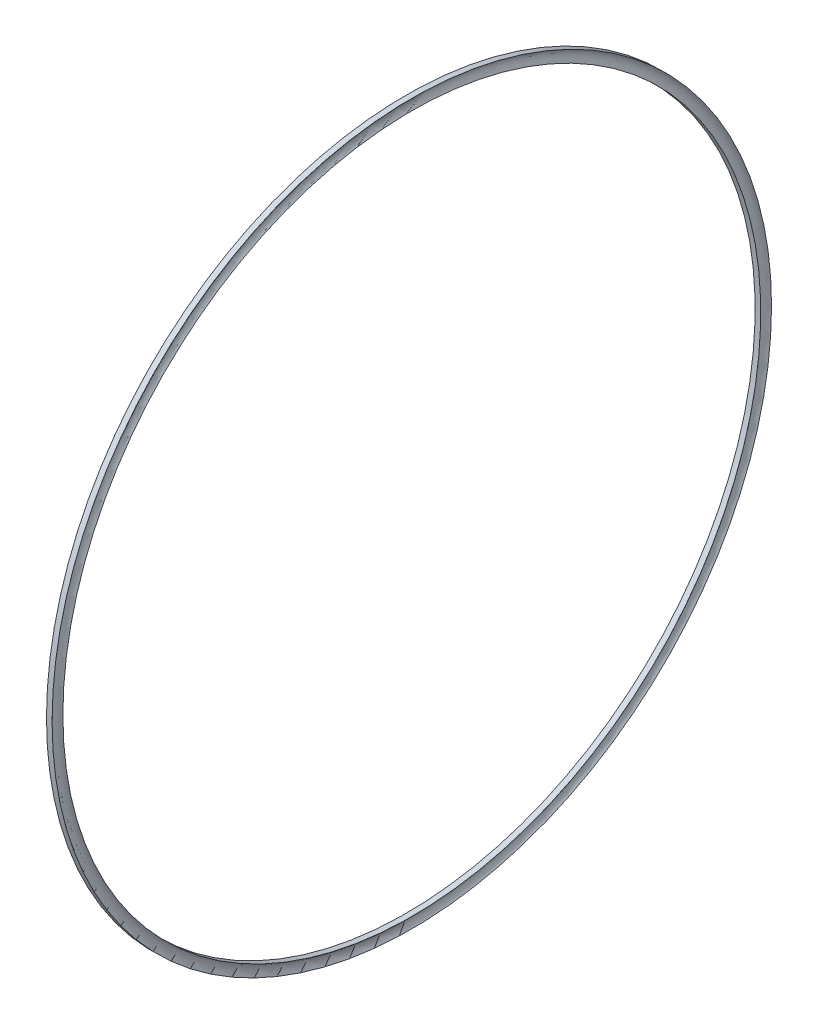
from build123d import *


with BuildPart() as part:
    # Sketch1 → Revolve1 (revolve)
    with BuildSketch(Plane.XY, mode=Mode.PRIVATE) as revolve1_sk:
        with BuildLine():
            Line((0, 184.785), (2.9718, 184.785))
            ThreePointArc((2.9718, 184.785), (1.923780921, 187.6425), (2.9718, 190.5))
            Line((2.9718, 190.5), (0, 190.5))
            Line((0, 190.5), (0, 184.785))
        make_face()
    revolve(revolve1_sk.sketch.rotate(Axis((0, 0, 0), (1, 0, 0)), 90), axis=Axis((0, 0, 0), (1, 0, 0)))


solid = part.part
